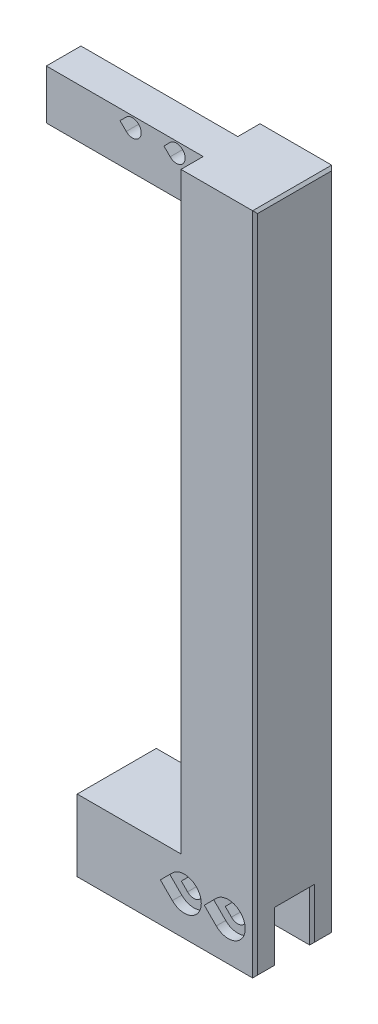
from build123d import *

# Parameters (mm, degrees)
SKETCH1_W           = 36
SKETCH1_H           = 16
BOSS_EXTRUDE1_DEPTH = 14.5
SKETCH2_W           = 7.1
SKETCH2_H           = 10.16
CUT_EXTRUDE1_DEPTH  = 31.75
CUT_EXTRUDE2_DEPTH  = 42.979161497
SKETCH3_3_R         = 3.43
SKETCH3_3_R_2       = 1.78
CUT_EXTRUDE3_DEPTH  = 1.91
CUT_EXTRUDE4_START  = -14.09
CUT_EXTRUDE4_DEPTH  = 1.91
SKETCH4_W           = 15
SKETCH4_H           = 16
BOSS_EXTRUDE2_DEPTH = 120
SKETCH5_W           = 7
SKETCH5_H           = 10
BOSS_EXTRUDE3_DEPTH = 31.75
SKETCH6_R           = 1.78
CUT_EXTRUDE5_DEPTH  = 7
SKETCH7_R           = 1.78
CUT_EXTRUDE8_DEPTH  = 4.25
SKETCH7_3_R         = 3.43
SKETCH7_3_R_2       = 1.78
CUT_EXTRUDE9_DEPTH  = 1.91
CHAMFER1_SIZE       = 0.5
SKETCH8_R           = 1.78
CUT_EXTRUDE10_DEPTH = 10


with BuildPart() as part:
    # Sketch1 → Boss-Extrude1 (new body)
    with BuildSketch(Plane(origin=(0, 0, 0), x_dir=(1, 0, 0), z_dir=(0, 1, 0))):
        with Locations((18, -8)):
            Rectangle(SKETCH1_W, SKETCH1_H)
    extrude(amount=BOSS_EXTRUDE1_DEPTH)

    # Sketch2 → Cut-Extrude1 (cut)
    with BuildSketch(Plane(origin=(36, 0, 0), x_dir=(0, 0, -1), z_dir=(1, 0, 0))):
        with Locations((-8, 5.08)):
            Rectangle(SKETCH2_W, SKETCH2_H)
    extrude(amount=-CUT_EXTRUDE1_DEPTH, mode=Mode.SUBTRACT)

    # Sketch3 → Cut-Extrude2 (cut, through all)
    with BuildSketch(Plane(origin=(0, 0, 0), x_dir=(-1, 0, 0), z_dir=(0, 0, -1))):
        with BuildLine():
            Line((-28.052699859, 7.87), (-29.311349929, 9.128650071))
            ThreePointArc((-29.311349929, 9.128650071), (-32.35, 7.87), (-29.311349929, 6.611349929))
            Line((-29.311349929, 6.611349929), (-28.052699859, 7.87))
        make_face()
        with BuildLine():
            Line((-19.162699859, 7.87), (-20.421349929, 9.128650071))
            ThreePointArc((-20.421349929, 9.128650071), (-23.46, 7.87), (-20.421349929, 6.611349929))
            Line((-20.421349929, 6.611349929), (-19.162699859, 7.87))
        make_face()
    extrude(amount=-CUT_EXTRUDE2_DEPTH, mode=Mode.SUBTRACT)

    # Sketch3_3 → Cut-Extrude3 (cut)
    # profile 1 of 4: a face of its own
    with BuildSketch(Plane(origin=(0, 0, 0), x_dir=(-1, 0, 0), z_dir=(0, 0, -1))):
        with Locations((-30.57, 7.87)):
            Circle(SKETCH3_3_R)
        with Locations((-30.57, 7.87)):
            Circle(SKETCH3_3_R_2, mode=Mode.SUBTRACT)
    # profile 2 of 4: a face of its own
    with BuildSketch(Plane(origin=(0, 0, 0), x_dir=(-1, 0, 0), z_dir=(0, 0, -1))):
        with Locations((-21.68, 7.87)):
            Circle(SKETCH3_3_R)
        with Locations((-21.68, 7.87)):
            Circle(SKETCH3_3_R_2, mode=Mode.SUBTRACT)
    # profile 3 of 4: a face of its own
    with BuildSketch(Plane(origin=(0, 0, 0), x_dir=(-1, 0, 0), z_dir=(0, 0, -1))):
        with BuildLine():
            Line((-25.719247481, 7.87), (-28.144623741, 10.295376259))
            ThreePointArc((-28.144623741, 10.295376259), (-27.401093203, 9.182604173), (-27.14, 7.87))
            ThreePointArc((-27.14, 7.87), (-27.401093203, 6.557395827), (-28.144623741, 5.444623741))
            Line((-28.144623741, 5.444623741), (-25.719247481, 7.87))
        make_face()
    # profile 4 of 4: a face of its own
    with BuildSketch(Plane(origin=(0, 0, 0), x_dir=(-1, 0, 0), z_dir=(0, 0, -1))):
        with BuildLine():
            Line((-16.829247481, 7.87), (-19.254623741, 10.295376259))
            ThreePointArc((-19.254623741, 10.295376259), (-18.511093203, 9.182604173), (-18.25, 7.87))
            ThreePointArc((-18.25, 7.87), (-18.511093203, 6.557395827), (-19.254623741, 5.444623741))
            Line((-19.254623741, 5.444623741), (-16.829247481, 7.87))
        make_face()
    extrude(amount=-CUT_EXTRUDE3_DEPTH, mode=Mode.SUBTRACT)

    # Sketch3_4 → Cut-Extrude4 (cut)
    # profile 1 of 4: a face of its own
    with BuildSketch(Plane(origin=(0, 0, 0), x_dir=(-1, 0, 0), z_dir=(0, 0, -1)).offset(CUT_EXTRUDE4_START)):
        with BuildLine():
            Line((-25.719247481, 7.87), (-28.144623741, 10.295376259))
            ThreePointArc((-28.144623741, 10.295376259), (-27.401093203, 9.182604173), (-27.14, 7.87))
            ThreePointArc((-27.14, 7.87), (-27.401093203, 6.557395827), (-28.144623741, 5.444623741))
            Line((-28.144623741, 5.444623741), (-25.719247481, 7.87))
        make_face()
    # profile 2 of 4: a face of its own
    with BuildSketch(Plane(origin=(0, 0, 0), x_dir=(-1, 0, 0), z_dir=(0, 0, -1)).offset(CUT_EXTRUDE4_START)):
        with BuildLine():
            ThreePointArc((-27.14, 7.87), (-27.401093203, 9.182604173), (-28.144623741, 10.295376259))
            ThreePointArc((-28.144623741, 10.295376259), (-34, 7.87), (-28.144623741, 5.444623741))
            ThreePointArc((-28.144623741, 5.444623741), (-27.401093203, 6.557395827), (-27.14, 7.87))
        make_face()
        with BuildLine():
            ThreePointArc((-29.311349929, 6.611349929), (-32.35, 7.87), (-29.311349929, 9.128650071))
            Line((-29.311349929, 9.128650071), (-28.052699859, 7.87))
            Line((-28.052699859, 7.87), (-29.311349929, 6.611349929))
        make_face(mode=Mode.SUBTRACT)
    # profile 3 of 4: a face of its own
    with BuildSketch(Plane(origin=(0, 0, 0), x_dir=(-1, 0, 0), z_dir=(0, 0, -1)).offset(CUT_EXTRUDE4_START)):
        with BuildLine():
            Line((-16.829247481, 7.87), (-19.254623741, 10.295376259))
            ThreePointArc((-19.254623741, 10.295376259), (-18.511093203, 9.182604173), (-18.25, 7.87))
            ThreePointArc((-18.25, 7.87), (-18.511093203, 6.557395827), (-19.254623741, 5.444623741))
            Line((-19.254623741, 5.444623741), (-16.829247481, 7.87))
        make_face()
    # profile 4 of 4: a face of its own
    with BuildSketch(Plane(origin=(0, 0, 0), x_dir=(-1, 0, 0), z_dir=(0, 0, -1)).offset(CUT_EXTRUDE4_START)):
        with BuildLine():
            ThreePointArc((-18.25, 7.87), (-18.511093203, 9.182604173), (-19.254623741, 10.295376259))
            ThreePointArc((-19.254623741, 10.295376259), (-25.11, 7.87), (-19.254623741, 5.444623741))
            ThreePointArc((-19.254623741, 5.444623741), (-18.511093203, 6.557395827), (-18.25, 7.87))
        make_face()
        with BuildLine():
            ThreePointArc((-20.421349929, 6.611349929), (-23.46, 7.87), (-20.421349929, 9.128650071))
            Line((-20.421349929, 9.128650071), (-19.162699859, 7.87))
            Line((-19.162699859, 7.87), (-20.421349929, 6.611349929))
        make_face(mode=Mode.SUBTRACT)
    extrude(amount=-CUT_EXTRUDE4_DEPTH, mode=Mode.SUBTRACT)

    # Sketch4 → Boss-Extrude2 (add)
    with BuildSketch(Plane(origin=(0, 14.5, 0), x_dir=(1, 0, 0), z_dir=(0, 1, 0))):
        with Locations((28.5, -8)):
            Rectangle(SKETCH4_W, SKETCH4_H)
    extrude(amount=BOSS_EXTRUDE2_DEPTH)

    # Sketch5 → Boss-Extrude3 (add)
    with BuildSketch(Plane.ZY.offset(-21)):
        with Locations((8, 129.5)):
            Rectangle(SKETCH5_W, SKETCH5_H)
    extrude(amount=BOSS_EXTRUDE3_DEPTH)

    # Sketch6 → Cut-Extrude5 (cut)
    with BuildSketch(Plane(origin=(0, 0, 4.5), x_dir=(-1, 0, 0), z_dir=(0, 0, -1))):
        with Locations((-6.68, 132.37)):
            Circle(SKETCH6_R)
        with Locations((-15.57, 132.37)):
            Circle(SKETCH6_R)
        with BuildLine():
            Line((-13.052699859, 132.37), (-14.311349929, 133.628650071))
            ThreePointArc((-14.311349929, 133.628650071), (-13.925494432, 133.05117651), (-13.79, 132.37))
            ThreePointArc((-13.79, 132.37), (-13.925494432, 131.68882349), (-14.311349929, 131.111349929))
            Line((-14.311349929, 131.111349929), (-13.052699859, 132.37))
        make_face()
        with BuildLine():
            Line((-4.162699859, 132.37), (-5.421349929, 133.628650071))
            ThreePointArc((-5.421349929, 133.628650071), (-5.035494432, 133.05117651), (-4.9, 132.37))
            ThreePointArc((-4.9, 132.37), (-5.035494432, 131.68882349), (-5.421349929, 131.111349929))
            Line((-5.421349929, 131.111349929), (-4.162699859, 132.37))
        make_face()
    extrude(amount=-CUT_EXTRUDE5_DEPTH, mode=Mode.SUBTRACT)

    # Sketch7 → Cut-Extrude8 (cut)
    with BuildSketch(Plane.ZY):
        with Locations((8, 7.87)):
            Circle(SKETCH7_R)
    extrude(amount=-CUT_EXTRUDE8_DEPTH, mode=Mode.SUBTRACT)

    # Sketch7_3 → Cut-Extrude9 (cut)
    with BuildSketch(Plane.ZY):
        with Locations((8, 7.87)):
            Circle(SKETCH7_3_R)
        with Locations((8, 7.87)):
            Circle(SKETCH7_3_R_2, mode=Mode.SUBTRACT)
    extrude(amount=-CUT_EXTRUDE9_DEPTH, mode=Mode.SUBTRACT)

    # Chamfer1
    chamfer1_edges = [part.edges().sort_by_distance(p)[0] for p in [
        (36, 0, 2.225),
        (36, 134.5, 8),
        (36, 5.08, 11.55),
        (36, 5.08, 4.45),
        (36, 10.16, 8),
        (36, 0, 13.775),
        (36, 67.25, 0),
        (36, 67.25, 16),
    ]]
    chamfer(chamfer1_edges, length=CHAMFER1_SIZE)

    # Sketch8 → Cut-Extrude10 (cut)
    with BuildSketch(Plane.ZY.offset(10.75)):
        with Locations((8, 132.37)):
            Circle(SKETCH8_R)
    extrude(amount=-CUT_EXTRUDE10_DEPTH, mode=Mode.SUBTRACT)


solid = part.part
